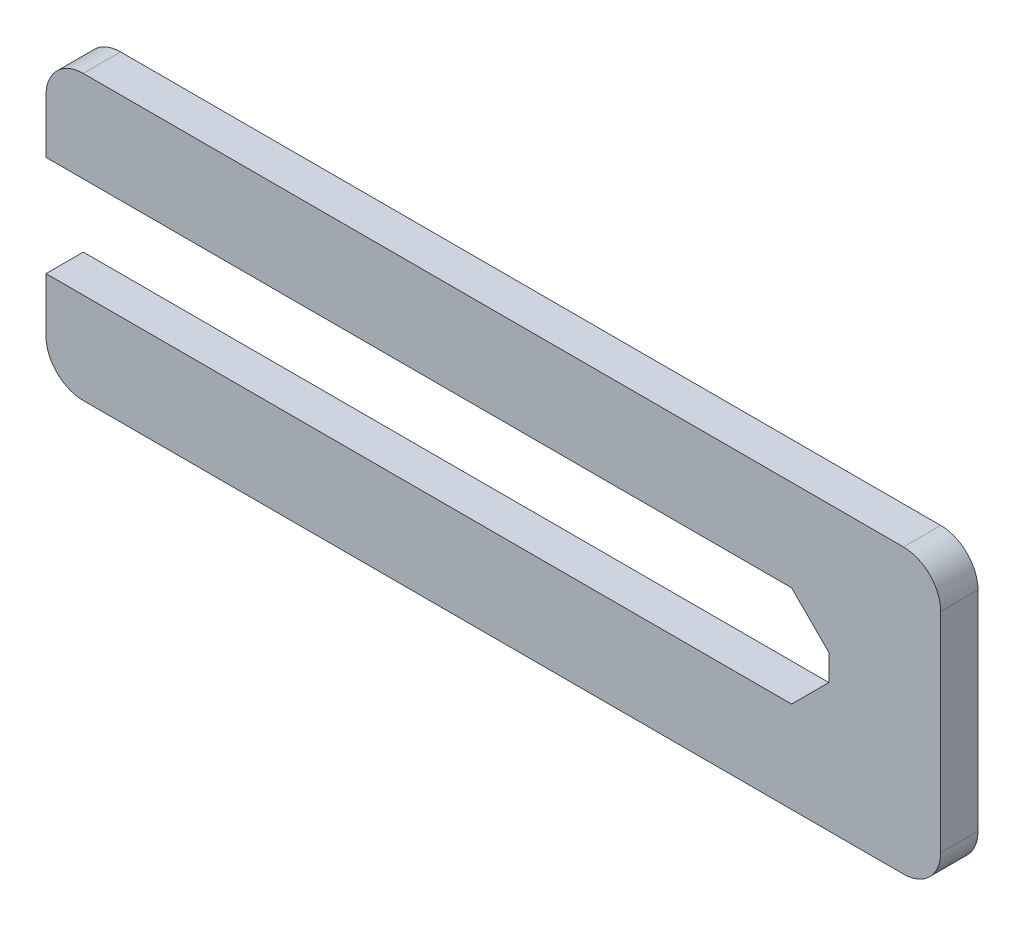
from build123d import *

# Parameters (mm, degrees)
ESQUISSE1_W      = 120
ESQUISSE1_H      = 38
EXTRUSION1_DEPTH = 5
ESQUISSE2_W      = 105
ESQUISSE2_H      = 13.5
EXTRUSION2_DEPTH = 6
CHANFREIN1_SIZE  = 5
CONG_1_R         = 5


with BuildPart() as part:
    # Esquisse1 → Extrusion1 (new body)
    with BuildSketch(Plane.XY):
        with Locations((60, 19)):
            Rectangle(ESQUISSE1_W, ESQUISSE1_H)
    extrude(amount=EXTRUSION1_DEPTH)

    # Esquisse2 → Extrusion2 (cut)
    with BuildSketch(Plane.XY.offset(5)):
        with Locations((52.5, 19)):
            Rectangle(ESQUISSE2_W, ESQUISSE2_H)
    extrude(amount=-EXTRUSION2_DEPTH, mode=Mode.SUBTRACT)

    # Chanfrein1
    chanfrein1_edges = [part.edges().sort_by_distance(p)[0] for p in [
        (105, 25.75, 2.5),
        (105, 12.25, 2.5),
    ]]
    chamfer(chanfrein1_edges, length=CHANFREIN1_SIZE)

    # Cong_1
    cong_1_edges = [part.edges().sort_by_distance(p)[0] for p in [
        (0, 38, 2.5),
        (120, 38, 2.5),
        (120, 0, 2.5),
        (0, 0, 2.5),
    ]]
    fillet(cong_1_edges, radius=CONG_1_R)


solid = part.part
